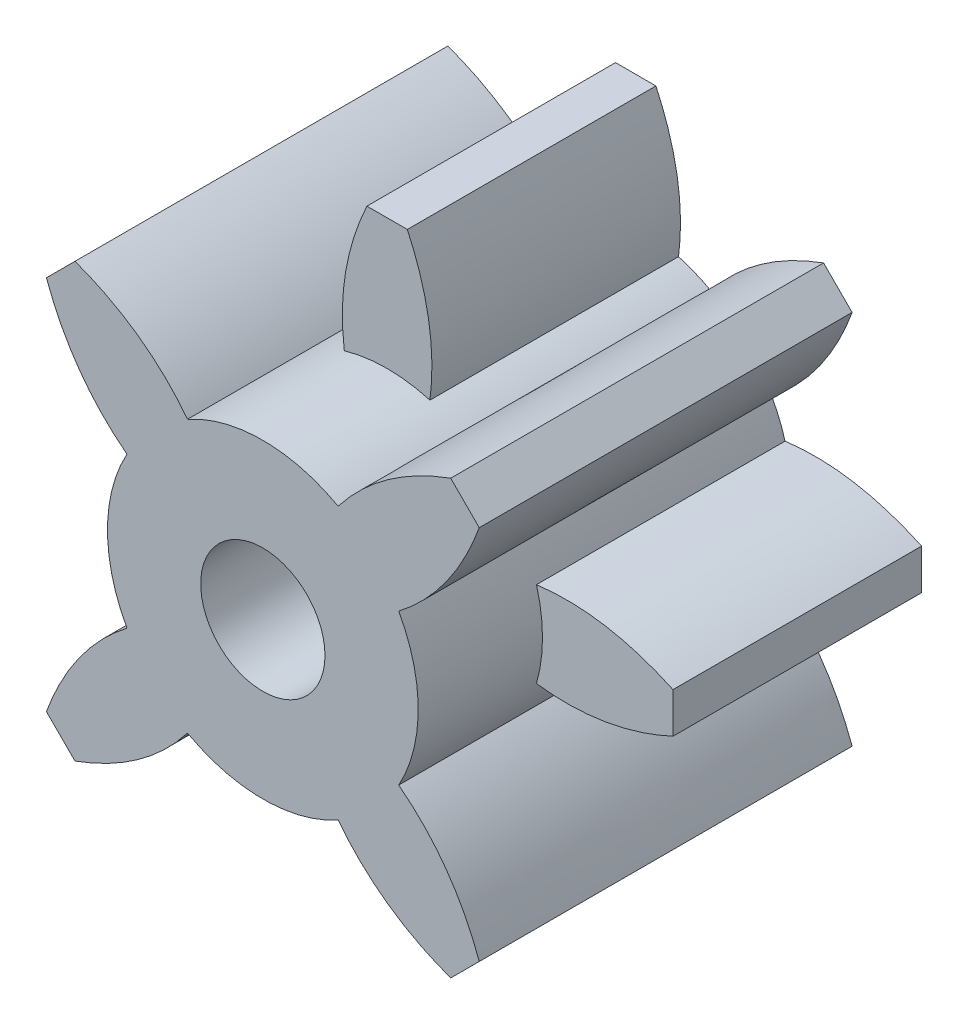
ISO-10303-21;
HEADER;
FILE_DESCRIPTION(('STEP AP214'),'2;1');
FILE_NAME('part.step','',(''),(''),'','','');
FILE_SCHEMA(('AUTOMOTIVE_DESIGN { 1 0 10303 214 1 1 1 1 }'));
ENDSEC;
DATA;
#1=APPLICATION_CONTEXT('core data for automotive mechanical design processes');
#2=APPLICATION_PROTOCOL_DEFINITION('international standard','automotive_design',2000,#1);
#3=PRODUCT_CONTEXT('',#1,'mechanical');
#4=PRODUCT('Part','Part','',(#3));
#5=PRODUCT_RELATED_PRODUCT_CATEGORY('part','',(#4));
#6=PRODUCT_DEFINITION_FORMATION('','',#4);
#7=PRODUCT_DEFINITION_CONTEXT('part definition',#1,'design');
#8=PRODUCT_DEFINITION('design','',#6,#7);
#9=PRODUCT_DEFINITION_SHAPE('','',#8);
#10=(LENGTH_UNIT() NAMED_UNIT(*) SI_UNIT(.MILLI.,.METRE.));
#11=(NAMED_UNIT(*) PLANE_ANGLE_UNIT() SI_UNIT($,.RADIAN.));
#12=(NAMED_UNIT(*) SI_UNIT($,.STERADIAN.) SOLID_ANGLE_UNIT());
#13=UNCERTAINTY_MEASURE_WITH_UNIT(LENGTH_MEASURE(1.E-05),#10,'distance_accuracy_value','');
#14=(GEOMETRIC_REPRESENTATION_CONTEXT(3) GLOBAL_UNCERTAINTY_ASSIGNED_CONTEXT((#13)) GLOBAL_UNIT_ASSIGNED_CONTEXT((#10,
#11,#12)) REPRESENTATION_CONTEXT('',''));
#15=CARTESIAN_POINT('',(0.,0.,0.));
#16=DIRECTION('',(0.,0.,1.));
#17=DIRECTION('',(1.,0.,0.));
#18=AXIS2_PLACEMENT_3D('',#15,#16,#17);
#19=CARTESIAN_POINT('',(0.,63.,-30.));
#20=DIRECTION('',(0.,0.,1.));
#21=DIRECTION('',(1.,0.,0.));
#22=AXIS2_PLACEMENT_3D('',#19,#20,#21);
#23=CYLINDRICAL_SURFACE('',#22,12.5);
#24=DIRECTION('',(0.,0.,1.));
#25=VECTOR('',#24,1.);
#26=CARTESIAN_POINT('',(-12.015771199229,66.4454669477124,-30.));
#27=LINE('',#26,#25);
#28=CARTESIAN_POINT('',(-12.015771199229,66.4454669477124,-30.));
#29=VERTEX_POINT('',#28);
#30=CARTESIAN_POINT('',(-12.0157712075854,66.4454669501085,-10.));
#31=VERTEX_POINT('',#30);
#32=EDGE_CURVE('E573',#29,#31,#27,.T.);
#33=ORIENTED_EDGE('',*,*,#32,.T.);
#34=CARTESIAN_POINT('',(0.,63.,-10.));
#35=DIRECTION('',(0.,0.,-1.));
#36=DIRECTION('',(1.,0.,0.));
#37=AXIS2_PLACEMENT_3D('',#34,#35,#36);
#38=CIRCLE('',#37,12.5000000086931);
#39=CARTESIAN_POINT('',(-12.0157712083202,59.5545330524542,-10.));
#40=VERTEX_POINT('',#39);
#41=EDGE_CURVE('E754',#40,#31,#38,.T.);
#42=ORIENTED_EDGE('',*,*,#41,.F.);
#43=DIRECTION('',(0.,0.,1.));
#44=VECTOR('',#43,1.);
#45=CARTESIAN_POINT('',(-12.0157712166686,59.5545330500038,-30.));
#46=LINE('',#45,#44);
#47=CARTESIAN_POINT('',(-12.0157712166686,59.5545330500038,-30.));
#48=VERTEX_POINT('',#47);
#49=EDGE_CURVE('E820',#48,#40,#46,.T.);
#50=ORIENTED_EDGE('',*,*,#49,.F.);
#51=CARTESIAN_POINT('',(0.,63.,-30.));
#52=DIRECTION('',(0.,0.,1.));
#53=DIRECTION('',(1.,0.,0.));
#54=AXIS2_PLACEMENT_3D('',#51,#52,#53);
#55=CIRCLE('',#54,12.5);
#56=CARTESIAN_POINT('',(-10.9327463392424,56.9398797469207,-30.));
#57=VERTEX_POINT('',#56);
#58=EDGE_CURVE('E477',#48,#57,#55,.T.);
#59=ORIENTED_EDGE('',*,*,#58,.T.);
#60=DIRECTION('',(0.,0.,1.));
#61=VECTOR('',#60,1.);
#62=CARTESIAN_POINT('',(-10.9327463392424,56.9398797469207,-30.));
#63=LINE('',#62,#61);
#64=CARTESIAN_POINT('',(-10.9327463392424,56.9398797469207,0.));
#65=VERTEX_POINT('',#64);
#66=EDGE_CURVE('E512',#57,#65,#63,.T.);
#67=ORIENTED_EDGE('',*,*,#66,.T.);
#68=CARTESIAN_POINT('',(0.,63.,0.));
#69=DIRECTION('',(0.,0.,1.));
#70=DIRECTION('',(1.,0.,0.));
#71=AXIS2_PLACEMENT_3D('',#68,#69,#70);
#72=CIRCLE('',#71,12.5);
#73=CARTESIAN_POINT('',(-10.9327463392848,69.0601202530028,0.));
#74=VERTEX_POINT('',#73);
#75=EDGE_CURVE('E443',#74,#65,#72,.T.);
#76=ORIENTED_EDGE('',*,*,#75,.F.);
#77=DIRECTION('',(0.,0.,1.));
#78=VECTOR('',#77,1.);
#79=CARTESIAN_POINT('',(-10.9327463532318,69.0601202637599,-30.));
#80=LINE('',#79,#78);
#81=CARTESIAN_POINT('',(-10.9327463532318,69.0601202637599,-30.));
#82=VERTEX_POINT('',#81);
#83=EDGE_CURVE('E594',#82,#74,#80,.T.);
#84=ORIENTED_EDGE('',*,*,#83,.F.);
#85=EDGE_CURVE('E474',#82,#29,#55,.T.);
#86=ORIENTED_EDGE('',*,*,#85,.T.);
#87=EDGE_LOOP('',(#33,#42,#50,#59,#67,#76,#84,#86));
#88=FACE_BOUND('',#87,.T.);
#89=ADVANCED_FACE('F39',(#88),#23,.T.);
#90=DIRECTION('',(0.,0.,1.));
#91=VECTOR('',#90,1.);
#92=CARTESIAN_POINT('',(3.44546694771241,75.015771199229,-30.));
#93=LINE('',#92,#91);
#94=CARTESIAN_POINT('',(3.44546694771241,75.015771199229,-30.));
#95=VERTEX_POINT('',#94);
#96=CARTESIAN_POINT('',(3.44546695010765,75.0157712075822,-10.));
#97=VERTEX_POINT('',#96);
#98=EDGE_CURVE('E651',#95,#97,#93,.T.);
#99=ORIENTED_EDGE('',*,*,#98,.T.);
#100=CARTESIAN_POINT('',(0.,63.,-10.));
#101=DIRECTION('',(0.,0.,-1.));
#102=DIRECTION('',(1.,0.,0.));
#103=AXIS2_PLACEMENT_3D('',#100,#101,#102);
#104=CIRCLE('',#103,12.5000000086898);
#105=CARTESIAN_POINT('',(-3.4454669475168,75.0157712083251,-10.));
#106=VERTEX_POINT('',#105);
#107=EDGE_CURVE('E727',#106,#97,#104,.T.);
#108=ORIENTED_EDGE('',*,*,#107,.F.);
#109=DIRECTION('',(0.,0.,1.));
#110=VECTOR('',#109,1.);
#111=CARTESIAN_POINT('',(-3.44546695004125,75.0157712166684,-30.));
#112=LINE('',#111,#110);
#113=CARTESIAN_POINT('',(-3.44546695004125,75.0157712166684,-30.));
#114=VERTEX_POINT('',#113);
#115=EDGE_CURVE('E854',#114,#106,#112,.T.);
#116=ORIENTED_EDGE('',*,*,#115,.F.);
#117=CARTESIAN_POINT('',(-6.06012025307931,73.9327463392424,-30.));
#118=VERTEX_POINT('',#117);
#119=EDGE_CURVE('E471',#114,#118,#55,.T.);
#120=ORIENTED_EDGE('',*,*,#119,.T.);
#121=DIRECTION('',(0.,0.,1.));
#122=VECTOR('',#121,1.);
#123=CARTESIAN_POINT('',(-6.06012025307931,73.9327463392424,-30.));
#124=LINE('',#123,#122);
#125=CARTESIAN_POINT('',(-6.06012025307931,73.9327463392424,0.));
#126=VERTEX_POINT('',#125);
#127=EDGE_CURVE('E586',#118,#126,#124,.T.);
#128=ORIENTED_EDGE('',*,*,#127,.T.);
#129=CARTESIAN_POINT('',(6.06012025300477,73.9327463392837,0.));
#130=VERTEX_POINT('',#129);
#131=EDGE_CURVE('E482',#130,#126,#72,.T.);
#132=ORIENTED_EDGE('',*,*,#131,.F.);
#133=DIRECTION('',(0.,0.,1.));
#134=VECTOR('',#133,1.);
#135=CARTESIAN_POINT('',(6.0601202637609,73.9327463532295,-30.));
#136=LINE('',#135,#134);
#137=CARTESIAN_POINT('',(6.0601202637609,73.9327463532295,-30.));
#138=VERTEX_POINT('',#137);
#139=EDGE_CURVE('E672',#138,#130,#136,.T.);
#140=ORIENTED_EDGE('',*,*,#139,.F.);
#141=EDGE_CURVE('E468',#138,#95,#55,.T.);
#142=ORIENTED_EDGE('',*,*,#141,.T.);
#143=EDGE_LOOP('',(#99,#108,#116,#120,#128,#132,#140,#142));
#144=FACE_BOUND('',#143,.T.);
#145=ADVANCED_FACE('F308',(#144),#23,.T.);
#146=DIRECTION('',(0.,0.,1.));
#147=VECTOR('',#146,1.);
#148=CARTESIAN_POINT('',(12.015771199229,59.5545330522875,-30.));
#149=LINE('',#148,#147);
#150=CARTESIAN_POINT('',(12.015771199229,59.5545330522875,-30.));
#151=VERTEX_POINT('',#150);
#152=CARTESIAN_POINT('',(12.0157712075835,59.5545330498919,-10.));
#153=VERTEX_POINT('',#152);
#154=EDGE_CURVE('E338',#151,#153,#149,.T.);
#155=ORIENTED_EDGE('',*,*,#154,.T.);
#156=CARTESIAN_POINT('',(0.,63.,-10.));
#157=DIRECTION('',(0.,0.,-1.));
#158=DIRECTION('',(1.,0.,0.));
#159=AXIS2_PLACEMENT_3D('',#156,#157,#158);
#160=CIRCLE('',#159,12.5000000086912);
#161=CARTESIAN_POINT('',(12.0157712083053,66.4454669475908,-10.));
#162=VERTEX_POINT('',#161);
#163=EDGE_CURVE('E262',#162,#153,#160,.T.);
#164=ORIENTED_EDGE('',*,*,#163,.F.);
#165=DIRECTION('',(0.,0.,1.));
#166=VECTOR('',#165,1.);
#167=CARTESIAN_POINT('',(12.0157712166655,66.4454669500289,-30.));
#168=LINE('',#167,#166);
#169=CARTESIAN_POINT('',(12.0157712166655,66.4454669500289,-30.));
#170=VERTEX_POINT('',#169);
#171=EDGE_CURVE('E349',#170,#162,#168,.T.);
#172=ORIENTED_EDGE('',*,*,#171,.F.);
#173=CARTESIAN_POINT('',(10.9327463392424,69.0601202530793,-30.));
#174=VERTEX_POINT('',#173);
#175=EDGE_CURVE('E465',#170,#174,#55,.T.);
#176=ORIENTED_EDGE('',*,*,#175,.T.);
#177=DIRECTION('',(0.,0.,1.));
#178=VECTOR('',#177,1.);
#179=CARTESIAN_POINT('',(10.9327463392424,69.0601202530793,-30.));
#180=LINE('',#179,#178);
#181=CARTESIAN_POINT('',(10.9327463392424,69.0601202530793,0.));
#182=VERTEX_POINT('',#181);
#183=EDGE_CURVE('E664',#174,#182,#180,.T.);
#184=ORIENTED_EDGE('',*,*,#183,.T.);
#185=CARTESIAN_POINT('',(10.932746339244,56.9398797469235,0.));
#186=VERTEX_POINT('',#185);
#187=EDGE_CURVE('E455',#186,#182,#72,.T.);
#188=ORIENTED_EDGE('',*,*,#187,.F.);
#189=DIRECTION('',(0.,0.,1.));
#190=VECTOR('',#189,1.);
#191=CARTESIAN_POINT('',(10.9327463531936,56.9398797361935,-30.));
#192=LINE('',#191,#190);
#193=CARTESIAN_POINT('',(10.9327463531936,56.9398797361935,-30.));
#194=VERTEX_POINT('',#193);
#195=EDGE_CURVE('E430',#194,#186,#192,.T.);
#196=ORIENTED_EDGE('',*,*,#195,.F.);
#197=EDGE_CURVE('E343',#194,#151,#55,.T.);
#198=ORIENTED_EDGE('',*,*,#197,.T.);
#199=EDGE_LOOP('',(#155,#164,#172,#176,#184,#188,#196,#198));
#200=FACE_BOUND('',#199,.T.);
#201=ADVANCED_FACE('F315',(#200),#23,.T.);
#202=CARTESIAN_POINT('',(999733.592448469,23772.4155449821,-30.));
#203=CARTESIAN_POINT('',(-999848.383256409,-17570.2259801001,-30.));
#204=CARTESIAN_POINT('',(999948.773053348,11560.9461127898,-30.));
#205=B_SPLINE_CURVE_WITH_KNOTS('',2,(#202,#203,#204),.UNSPECIFIED.,.F.,.F.,(3,3),(0.,1.),.UNSPECIFIED.);
#206=DIRECTION('',(0.,0.,1.));
#207=VECTOR('',#206,1.);
#208=SURFACE_OF_LINEAR_EXTRUSION('',#205,#207);
#209=CARTESIAN_POINT('',(999733.59244847,23772.4155449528,-10.));
#210=CARTESIAN_POINT('',(-999848.383256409,-17570.2259801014,-10.));
#211=CARTESIAN_POINT('',(999948.773053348,11560.9461128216,-10.));
#212=B_SPLINE_CURVE_WITH_KNOTS('',2,(#209,#210,#211),.UNSPECIFIED.,.F.,.F.,(3,3),(0.,1.),.UNSPECIFIED.);
#213=CARTESIAN_POINT('',(-3.44546695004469,50.9842287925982,-10.));
#214=VERTEX_POINT('',#213);
#215=CARTESIAN_POINT('',(-1.62499998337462,39.999999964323,-10.));
#216=VERTEX_POINT('',#215);
#217=EDGE_CURVE('E251',#214,#216,#212,.T.);
#218=ORIENTED_EDGE('',*,*,#217,.F.);
#219=DIRECTION('',(0.,0.,1.));
#220=VECTOR('',#219,1.);
#221=CARTESIAN_POINT('',(-3.4454669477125,50.984228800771,-30.));
#222=LINE('',#221,#220);
#223=CARTESIAN_POINT('',(-3.44546694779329,50.9842288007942,-30.));
#224=VERTEX_POINT('',#223);
#225=EDGE_CURVE('E11',#224,#214,#222,.T.);
#226=ORIENTED_EDGE('',*,*,#225,.F.);
#227=CARTESIAN_POINT('',(-1.625,40.,-30.));
#228=VERTEX_POINT('',#227);
#229=EDGE_CURVE('E275',#224,#228,#205,.T.);
#230=ORIENTED_EDGE('',*,*,#229,.T.);
#231=DIRECTION('',(0.,0.,1.));
#232=VECTOR('',#231,1.);
#233=CARTESIAN_POINT('',(-1.625,40.,-30.));
#234=LINE('',#233,#232);
#235=EDGE_CURVE('E44',#228,#216,#234,.T.);
#236=ORIENTED_EDGE('',*,*,#235,.T.);
#237=EDGE_LOOP('',(#218,#226,#230,#236));
#238=FACE_BOUND('',#237,.T.);
#239=ADVANCED_FACE('F41',(#238),#208,.T.);
#240=CARTESIAN_POINT('',(-999948.773053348,11560.9461127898,-30.));
#241=CARTESIAN_POINT('',(999848.383256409,-17570.2259801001,-30.));
#242=CARTESIAN_POINT('',(-999733.592448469,23772.4155449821,-30.));
#243=B_SPLINE_CURVE_WITH_KNOTS('',2,(#240,#241,#242),.UNSPECIFIED.,.F.,.F.,(3,3),(0.,1.),.UNSPECIFIED.);
#244=DIRECTION('',(0.,0.,1.));
#245=VECTOR('',#244,1.);
#246=SURFACE_OF_LINEAR_EXTRUSION('',#243,#245);
#247=CARTESIAN_POINT('',(-999948.773053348,11560.9461127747,-10.));
#248=CARTESIAN_POINT('',(999848.383256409,-17570.2259800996,-10.));
#249=CARTESIAN_POINT('',(-999733.592448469,23772.415544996,-10.));
#250=B_SPLINE_CURVE_WITH_KNOTS('',2,(#247,#248,#249),.UNSPECIFIED.,.F.,.F.,(3,3),(0.,1.),.UNSPECIFIED.);
#251=CARTESIAN_POINT('',(1.62500000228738,40.0000000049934,-10.));
#252=VERTEX_POINT('',#251);
#253=CARTESIAN_POINT('',(3.44546694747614,50.9842287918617,-10.));
#254=VERTEX_POINT('',#253);
#255=EDGE_CURVE('E271',#252,#254,#250,.T.);
#256=ORIENTED_EDGE('',*,*,#255,.F.);
#257=DIRECTION('',(0.,0.,1.));
#258=VECTOR('',#257,1.);
#259=CARTESIAN_POINT('',(1.625,40.,-30.));
#260=LINE('',#259,#258);
#261=CARTESIAN_POINT('',(1.625,40.,-30.));
#262=VERTEX_POINT('',#261);
#263=EDGE_CURVE('E269',#262,#252,#260,.T.);
#264=ORIENTED_EDGE('',*,*,#263,.F.);
#265=CARTESIAN_POINT('',(3.44546694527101,50.9842288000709,-30.));
#266=VERTEX_POINT('',#265);
#267=EDGE_CURVE('E277',#262,#266,#243,.T.);
#268=ORIENTED_EDGE('',*,*,#267,.T.);
#269=DIRECTION('',(0.,0.,1.));
#270=VECTOR('',#269,1.);
#271=CARTESIAN_POINT('',(3.44546695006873,50.9842287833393,-30.));
#272=LINE('',#271,#270);
#273=EDGE_CURVE('E50',#266,#254,#272,.T.);
#274=ORIENTED_EDGE('',*,*,#273,.T.);
#275=EDGE_LOOP('',(#256,#264,#268,#274));
#276=FACE_BOUND('',#275,.T.);
#277=ADVANCED_FACE('F296',(#276),#246,.T.);
#278=CARTESIAN_POINT('',(-1.625,40.,-30.));
#279=DIRECTION('',(0.,-1.,0.));
#280=DIRECTION('',(0.,0.,-1.));
#281=AXIS2_PLACEMENT_3D('',#278,#279,#280);
#282=PLANE('',#281);
#283=DIRECTION('',(1.,1.09775330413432E-08,0.));
#284=VECTOR('',#283,1.);
#285=CARTESIAN_POINT('',(-1.62499998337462,39.999999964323,-10.));
#286=LINE('',#285,#284);
#287=EDGE_CURVE('E254',#216,#252,#286,.T.);
#288=ORIENTED_EDGE('',*,*,#287,.F.);
#289=ORIENTED_EDGE('',*,*,#235,.F.);
#290=DIRECTION('',(1.,0.,0.));
#291=VECTOR('',#290,1.);
#292=CARTESIAN_POINT('',(-1.625,40.,-30.));
#293=LINE('',#292,#291);
#294=EDGE_CURVE('E281',#228,#262,#293,.T.);
#295=ORIENTED_EDGE('',*,*,#294,.T.);
#296=ORIENTED_EDGE('',*,*,#263,.T.);
#297=EDGE_LOOP('',(#288,#289,#295,#296));
#298=FACE_BOUND('',#297,.T.);
#299=ADVANCED_FACE('F266',(#298),#282,.T.);
#300=CARTESIAN_POINT('',(-3.60025275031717,48.2274243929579,-30.));
#301=DIRECTION('',(0.,0.,1.));
#302=DIRECTION('',(1.,0.,0.));
#303=AXIS2_PLACEMENT_3D('',#300,#301,#302);
#304=PLANE('',#303);
#305=ORIENTED_EDGE('',*,*,#229,.F.);
#306=CARTESIAN_POINT('',(-6.06012026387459,52.067253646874,-30.));
#307=VERTEX_POINT('',#306);
#308=EDGE_CURVE('E451',#307,#224,#55,.T.);
#309=ORIENTED_EDGE('',*,*,#308,.F.);
#310=CARTESIAN_POINT('',(-698940.282599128,715263.833931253,-30.));
#311=CARTESIAN_POINT('',(694530.998294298,-719405.145623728,-30.));
#312=CARTESIAN_POINT('',(-690153.314090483,723746.49111012,-30.));
#313=B_SPLINE_CURVE_WITH_KNOTS('',2,(#310,#311,#312),.UNSPECIFIED.,.F.,.F.,(3,3),(0.,1.),.UNSPECIFIED.);
#314=CARTESIAN_POINT('',(-15.1144074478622,45.5874955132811,-30.));
#315=VERTEX_POINT('',#314);
#316=EDGE_CURVE('E509',#315,#307,#313,.T.);
#317=ORIENTED_EDGE('',*,*,#316,.F.);
#318=DIRECTION('',(0.707106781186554,-0.707106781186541,0.));
#319=VECTOR('',#318,1.);
#320=CARTESIAN_POINT('',(-17.4125044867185,47.8855925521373,-30.));
#321=LINE('',#320,#319);
#322=CARTESIAN_POINT('',(-17.4125044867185,47.8855925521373,-30.));
#323=VERTEX_POINT('',#322);
#324=EDGE_CURVE('E794',#323,#315,#321,.T.);
#325=ORIENTED_EDGE('',*,*,#324,.F.);
#326=CARTESIAN_POINT('',(723683.491110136,-690090.314090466,-30.));
#327=CARTESIAN_POINT('',(-719468.145623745,694593.99829428,-30.));
#328=CARTESIAN_POINT('',(715200.83393127,-698877.282599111,-30.));
#329=B_SPLINE_CURVE_WITH_KNOTS('',2,(#326,#327,#328),.UNSPECIFIED.,.F.,.F.,(3,3),(0.,1.),.UNSPECIFIED.);
#330=EDGE_CURVE('E504',#57,#323,#329,.T.);
#331=ORIENTED_EDGE('',*,*,#330,.F.);
#332=ORIENTED_EDGE('',*,*,#58,.F.);
#333=CARTESIAN_POINT('',(11497.9461127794,1000011.77305335,-30.));
#334=CARTESIAN_POINT('',(-17633.2259800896,-999785.383256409,-30.));
#335=CARTESIAN_POINT('',(23709.4155449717,999796.59244847,-30.));
#336=B_SPLINE_CURVE_WITH_KNOTS('',2,(#333,#334,#335),.UNSPECIFIED.,.F.,.F.,(3,3),(0.,1.),.UNSPECIFIED.);
#337=CARTESIAN_POINT('',(-23.,61.3749999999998,-30.));
#338=VERTEX_POINT('',#337);
#339=EDGE_CURVE('E808',#338,#48,#336,.T.);
#340=ORIENTED_EDGE('',*,*,#339,.F.);
#341=DIRECTION('',(0.,-1.,0.));
#342=VECTOR('',#341,1.);
#343=CARTESIAN_POINT('',(-23.,64.6249999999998,-30.));
#344=LINE('',#343,#342);
#345=CARTESIAN_POINT('',(-23.,64.6249999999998,-30.));
#346=VERTEX_POINT('',#345);
#347=EDGE_CURVE('E531',#346,#338,#344,.T.);
#348=ORIENTED_EDGE('',*,*,#347,.F.);
#349=CARTESIAN_POINT('',(23709.4155449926,-999670.592448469,-30.));
#350=CARTESIAN_POINT('',(-17633.2259801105,999911.383256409,-30.));
#351=CARTESIAN_POINT('',(11497.9461128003,-999885.773053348,-30.));
#352=B_SPLINE_CURVE_WITH_KNOTS('',2,(#349,#350,#351),.UNSPECIFIED.,.F.,.F.,(3,3),(0.,1.),.UNSPECIFIED.);
#353=EDGE_CURVE('E518',#29,#346,#352,.T.);
#354=ORIENTED_EDGE('',*,*,#353,.F.);
#355=ORIENTED_EDGE('',*,*,#85,.F.);
#356=CARTESIAN_POINT('',(715200.833931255,699003.282599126,-30.));
#357=CARTESIAN_POINT('',(-719468.14562373,-694467.998294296,-30.));
#358=CARTESIAN_POINT('',(723683.491110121,690216.314090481,-30.));
#359=B_SPLINE_CURVE_WITH_KNOTS('',2,(#356,#357,#358),.UNSPECIFIED.,.F.,.F.,(3,3),(0.,1.),.UNSPECIFIED.);
#360=CARTESIAN_POINT('',(-17.4125044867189,78.1144074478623,-30.));
#361=VERTEX_POINT('',#360);
#362=EDGE_CURVE('E553',#361,#82,#359,.T.);
#363=ORIENTED_EDGE('',*,*,#362,.F.);
#364=DIRECTION('',(-0.707106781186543,-0.707106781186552,0.));
#365=VECTOR('',#364,1.);
#366=CARTESIAN_POINT('',(-15.1144074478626,80.4125044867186,-30.));
#367=LINE('',#366,#365);
#368=CARTESIAN_POINT('',(-15.1144074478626,80.4125044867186,-30.));
#369=VERTEX_POINT('',#368);
#370=EDGE_CURVE('E561',#369,#361,#367,.T.);
#371=ORIENTED_EDGE('',*,*,#370,.F.);
#372=CARTESIAN_POINT('',(-690153.314090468,-723620.491110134,-30.));
#373=CARTESIAN_POINT('',(694530.998294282,719531.145623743,-30.));
#374=CARTESIAN_POINT('',(-698940.282599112,-715137.833931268,-30.));
#375=B_SPLINE_CURVE_WITH_KNOTS('',2,(#372,#373,#374),.UNSPECIFIED.,.F.,.F.,(3,3),(0.,1.),.UNSPECIFIED.);
#376=EDGE_CURVE('E585',#118,#369,#375,.T.);
#377=ORIENTED_EDGE('',*,*,#376,.F.);
#378=ORIENTED_EDGE('',*,*,#119,.F.);
#379=CARTESIAN_POINT('',(999948.773053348,-11434.9461127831,-30.));
#380=CARTESIAN_POINT('',(-999848.383256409,17696.2259800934,-30.));
#381=CARTESIAN_POINT('',(999733.59244847,-23646.4155449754,-30.));
#382=B_SPLINE_CURVE_WITH_KNOTS('',2,(#379,#380,#381),.UNSPECIFIED.,.F.,.F.,(3,3),(0.,1.),.UNSPECIFIED.);
#383=CARTESIAN_POINT('',(-1.62500000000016,86.,-30.));
#384=VERTEX_POINT('',#383);
#385=EDGE_CURVE('E842',#384,#114,#382,.T.);
#386=ORIENTED_EDGE('',*,*,#385,.F.);
#387=DIRECTION('',(-1.,0.,0.));
#388=VECTOR('',#387,1.);
#389=CARTESIAN_POINT('',(1.62499999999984,86.,-30.));
#390=LINE('',#389,#388);
#391=CARTESIAN_POINT('',(1.62499999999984,86.,-30.));
#392=VERTEX_POINT('',#391);
#393=EDGE_CURVE('E609',#392,#384,#390,.T.);
#394=ORIENTED_EDGE('',*,*,#393,.F.);
#395=CARTESIAN_POINT('',(-999733.592448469,-23646.4155449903,-30.));
#396=CARTESIAN_POINT('',(999848.383256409,17696.2259801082,-30.));
#397=CARTESIAN_POINT('',(-999948.773053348,-11434.946112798,-30.));
#398=B_SPLINE_CURVE_WITH_KNOTS('',2,(#395,#396,#397),.UNSPECIFIED.,.F.,.F.,(3,3),(0.,1.),.UNSPECIFIED.);
#399=EDGE_CURVE('E593',#95,#392,#398,.T.);
#400=ORIENTED_EDGE('',*,*,#399,.F.);
#401=ORIENTED_EDGE('',*,*,#141,.F.);
#402=CARTESIAN_POINT('',(698940.282599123,-715137.833931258,-30.));
#403=CARTESIAN_POINT('',(-694530.998294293,719531.145623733,-30.));
#404=CARTESIAN_POINT('',(690153.314090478,-723620.491110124,-30.));
#405=B_SPLINE_CURVE_WITH_KNOTS('',2,(#402,#403,#404),.UNSPECIFIED.,.F.,.F.,(3,3),(0.,1.),.UNSPECIFIED.);
#406=CARTESIAN_POINT('',(15.1144074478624,80.4125044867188,-30.));
#407=VERTEX_POINT('',#406);
#408=EDGE_CURVE('E631',#407,#138,#405,.T.);
#409=ORIENTED_EDGE('',*,*,#408,.F.);
#410=DIRECTION('',(-0.707106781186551,0.707106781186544,0.));
#411=VECTOR('',#410,1.);
#412=CARTESIAN_POINT('',(17.4125044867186,78.1144074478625,-30.));
#413=LINE('',#412,#411);
#414=CARTESIAN_POINT('',(17.4125044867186,78.1144074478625,-30.));
#415=VERTEX_POINT('',#414);
#416=EDGE_CURVE('E639',#415,#407,#413,.T.);
#417=ORIENTED_EDGE('',*,*,#416,.F.);
#418=CARTESIAN_POINT('',(-723683.491110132,690216.31409047,-30.));
#419=CARTESIAN_POINT('',(719468.145623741,-694467.998294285,-30.));
#420=CARTESIAN_POINT('',(-715200.833931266,699003.282599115,-30.));
#421=B_SPLINE_CURVE_WITH_KNOTS('',2,(#418,#419,#420),.UNSPECIFIED.,.F.,.F.,(3,3),(0.,1.),.UNSPECIFIED.);
#422=EDGE_CURVE('E663',#174,#415,#421,.T.);
#423=ORIENTED_EDGE('',*,*,#422,.F.);
#424=ORIENTED_EDGE('',*,*,#175,.F.);
#425=CARTESIAN_POINT('',(-11497.9461127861,-999885.773053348,-30.));
#426=CARTESIAN_POINT('',(17633.2259800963,999911.383256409,-30.));
#427=CARTESIAN_POINT('',(-23709.4155449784,-999670.592448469,-30.));
#428=B_SPLINE_CURVE_WITH_KNOTS('',2,(#425,#426,#427),.UNSPECIFIED.,.F.,.F.,(3,3),(0.,1.),.UNSPECIFIED.);
#429=CARTESIAN_POINT('',(23.,64.6250000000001,-30.));
#430=VERTEX_POINT('',#429);
#431=EDGE_CURVE('E359',#430,#170,#428,.T.);
#432=ORIENTED_EDGE('',*,*,#431,.F.);
#433=DIRECTION('',(0.,1.,0.));
#434=VECTOR('',#433,1.);
#435=CARTESIAN_POINT('',(23.,61.3750000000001,-30.));
#436=LINE('',#435,#434);
#437=CARTESIAN_POINT('',(23.,61.3750000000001,-30.));
#438=VERTEX_POINT('',#437);
#439=EDGE_CURVE('E684',#438,#430,#436,.T.);
#440=ORIENTED_EDGE('',*,*,#439,.F.);
#441=CARTESIAN_POINT('',(-23709.4155449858,999796.592448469,-30.));
#442=CARTESIAN_POINT('',(17633.2259801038,-999785.383256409,-30.));
#443=CARTESIAN_POINT('',(-11497.9461127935,1000011.77305335,-30.));
#444=B_SPLINE_CURVE_WITH_KNOTS('',2,(#441,#442,#443),.UNSPECIFIED.,.F.,.F.,(3,3),(0.,1.),.UNSPECIFIED.);
#445=EDGE_CURVE('E671',#151,#438,#444,.T.);
#446=ORIENTED_EDGE('',*,*,#445,.F.);
#447=ORIENTED_EDGE('',*,*,#197,.F.);
#448=CARTESIAN_POINT('',(-715200.83393126,-698877.282599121,-30.));
#449=CARTESIAN_POINT('',(719468.145623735,694593.998294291,-30.));
#450=CARTESIAN_POINT('',(-723683.491110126,-690090.314090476,-30.));
#451=B_SPLINE_CURVE_WITH_KNOTS('',2,(#448,#449,#450),.UNSPECIFIED.,.F.,.F.,(3,3),(0.,1.),.UNSPECIFIED.);
#452=CARTESIAN_POINT('',(17.4125044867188,47.8855925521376,-30.));
#453=VERTEX_POINT('',#452);
#454=EDGE_CURVE('E400',#453,#194,#451,.T.);
#455=ORIENTED_EDGE('',*,*,#454,.F.);
#456=DIRECTION('',(0.707106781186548,0.707106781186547,0.));
#457=VECTOR('',#456,1.);
#458=CARTESIAN_POINT('',(15.1144074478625,45.5874955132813,-30.));
#459=LINE('',#458,#457);
#460=CARTESIAN_POINT('',(15.1144074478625,45.5874955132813,-30.));
#461=VERTEX_POINT('',#460);
#462=EDGE_CURVE('E379',#461,#453,#459,.T.);
#463=ORIENTED_EDGE('',*,*,#462,.F.);
#464=CARTESIAN_POINT('',(690153.314090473,723746.491110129,-30.));
#465=CARTESIAN_POINT('',(-694530.998294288,-719405.145623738,-30.));
#466=CARTESIAN_POINT('',(698940.282599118,715263.833931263,-30.));
#467=B_SPLINE_CURVE_WITH_KNOTS('',2,(#464,#465,#466),.UNSPECIFIED.,.F.,.F.,(3,3),(0.,1.),.UNSPECIFIED.);
#468=CARTESIAN_POINT('',(6.06012025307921,52.0672536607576,-30.));
#469=VERTEX_POINT('',#468);
#470=EDGE_CURVE('E372',#469,#461,#467,.T.);
#471=ORIENTED_EDGE('',*,*,#470,.F.);
#472=EDGE_CURVE('E447',#266,#469,#55,.T.);
#473=ORIENTED_EDGE('',*,*,#472,.F.);
#474=ORIENTED_EDGE('',*,*,#267,.F.);
#475=ORIENTED_EDGE('',*,*,#294,.F.);
#476=EDGE_LOOP('',(#305,#309,#317,#325,#331,#332,#340,#348,#354,#355,#363,#371,#377,#378,#386,
#394,#400,#401,#409,#417,#423,#424,#432,#440,#446,#447,#455,#463,#471,#473,#474,#475));
#477=FACE_BOUND('',#476,.T.);
#478=CARTESIAN_POINT('',(0.,63.,-30.));
#479=DIRECTION('',(0.,0.,1.));
#480=DIRECTION('',(1.,0.,0.));
#481=AXIS2_PLACEMENT_3D('',#478,#479,#480);
#482=CIRCLE('',#481,5.);
#483=CARTESIAN_POINT('',(5.,63.,-30.));
#484=VERTEX_POINT('',#483);
#485=EDGE_CURVE('E439',#484,#484,#482,.T.);
#486=ORIENTED_EDGE('',*,*,#485,.T.);
#487=EDGE_LOOP('',(#486));
#488=FACE_BOUND('',#487,.T.);
#489=ADVANCED_FACE('F302',(#477,#488),#304,.F.);
#490=CARTESIAN_POINT('',(-3.60025275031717,48.2274243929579,0.));
#491=DIRECTION('',(0.,0.,1.));
#492=DIRECTION('',(1.,0.,0.));
#493=AXIS2_PLACEMENT_3D('',#490,#491,#492);
#494=PLANE('',#493);
#495=CARTESIAN_POINT('',(-698940.282599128,715263.833931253,0.));
#496=CARTESIAN_POINT('',(694530.998294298,-719405.145623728,0.));
#497=CARTESIAN_POINT('',(-690153.314090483,723746.49111012,0.));
#498=B_SPLINE_CURVE_WITH_KNOTS('',2,(#495,#496,#497),.UNSPECIFIED.,.F.,.F.,(3,3),(0.,1.),.UNSPECIFIED.);
#499=CARTESIAN_POINT('',(-15.1144074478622,45.5874955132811,0.));
#500=VERTEX_POINT('',#499);
#501=CARTESIAN_POINT('',(-6.06012025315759,52.067253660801,0.));
#502=VERTEX_POINT('',#501);
#503=EDGE_CURVE('E497',#500,#502,#498,.T.);
#504=ORIENTED_EDGE('',*,*,#503,.T.);
#505=CARTESIAN_POINT('',(6.06012025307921,52.0672536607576,0.));
#506=VERTEX_POINT('',#505);
#507=EDGE_CURVE('E452',#502,#506,#72,.T.);
#508=ORIENTED_EDGE('',*,*,#507,.T.);
#509=CARTESIAN_POINT('',(690153.314090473,723746.491110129,0.));
#510=CARTESIAN_POINT('',(-694530.998294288,-719405.145623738,0.));
#511=CARTESIAN_POINT('',(698940.282599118,715263.833931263,0.));
#512=B_SPLINE_CURVE_WITH_KNOTS('',2,(#509,#510,#511),.UNSPECIFIED.,.F.,.F.,(3,3),(0.,1.),.UNSPECIFIED.);
#513=CARTESIAN_POINT('',(15.1144074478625,45.5874955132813,0.));
#514=VERTEX_POINT('',#513);
#515=EDGE_CURVE('E348',#506,#514,#512,.T.);
#516=ORIENTED_EDGE('',*,*,#515,.T.);
#517=DIRECTION('',(0.707106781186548,0.707106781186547,0.));
#518=VECTOR('',#517,1.);
#519=CARTESIAN_POINT('',(15.1144074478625,45.5874955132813,0.));
#520=LINE('',#519,#518);
#521=CARTESIAN_POINT('',(17.4125044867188,47.8855925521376,0.));
#522=VERTEX_POINT('',#521);
#523=EDGE_CURVE('E354',#514,#522,#520,.T.);
#524=ORIENTED_EDGE('',*,*,#523,.T.);
#525=CARTESIAN_POINT('',(-715200.83393126,-698877.282599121,0.));
#526=CARTESIAN_POINT('',(719468.145623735,694593.998294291,0.));
#527=CARTESIAN_POINT('',(-723683.491110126,-690090.314090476,0.));
#528=B_SPLINE_CURVE_WITH_KNOTS('',2,(#525,#526,#527),.UNSPECIFIED.,.F.,.F.,(3,3),(0.,1.),.UNSPECIFIED.);
#529=EDGE_CURVE('E380',#522,#186,#528,.T.);
#530=ORIENTED_EDGE('',*,*,#529,.T.);
#531=ORIENTED_EDGE('',*,*,#187,.T.);
#532=CARTESIAN_POINT('',(-723683.491110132,690216.31409047,0.));
#533=CARTESIAN_POINT('',(719468.145623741,-694467.998294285,0.));
#534=CARTESIAN_POINT('',(-715200.833931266,699003.282599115,0.));
#535=B_SPLINE_CURVE_WITH_KNOTS('',2,(#532,#533,#534),.UNSPECIFIED.,.F.,.F.,(3,3),(0.,1.),.UNSPECIFIED.);
#536=CARTESIAN_POINT('',(17.4125044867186,78.1144074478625,0.));
#537=VERTEX_POINT('',#536);
#538=EDGE_CURVE('E641',#182,#537,#535,.T.);
#539=ORIENTED_EDGE('',*,*,#538,.T.);
#540=DIRECTION('',(-0.707106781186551,0.707106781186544,0.));
#541=VECTOR('',#540,1.);
#542=CARTESIAN_POINT('',(17.4125044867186,78.1144074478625,0.));
#543=LINE('',#542,#541);
#544=CARTESIAN_POINT('',(15.1144074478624,80.4125044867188,0.));
#545=VERTEX_POINT('',#544);
#546=EDGE_CURVE('E650',#537,#545,#543,.T.);
#547=ORIENTED_EDGE('',*,*,#546,.T.);
#548=CARTESIAN_POINT('',(698940.282599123,-715137.833931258,0.));
#549=CARTESIAN_POINT('',(-694530.998294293,719531.145623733,0.));
#550=CARTESIAN_POINT('',(690153.314090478,-723620.491110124,0.));
#551=B_SPLINE_CURVE_WITH_KNOTS('',2,(#548,#549,#550),.UNSPECIFIED.,.F.,.F.,(3,3),(0.,1.),.UNSPECIFIED.);
#552=EDGE_CURVE('E658',#545,#130,#551,.T.);
#553=ORIENTED_EDGE('',*,*,#552,.T.);
#554=ORIENTED_EDGE('',*,*,#131,.T.);
#555=CARTESIAN_POINT('',(-690153.314090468,-723620.491110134,0.));
#556=CARTESIAN_POINT('',(694530.998294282,719531.145623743,0.));
#557=CARTESIAN_POINT('',(-698940.282599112,-715137.833931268,0.));
#558=B_SPLINE_CURVE_WITH_KNOTS('',2,(#555,#556,#557),.UNSPECIFIED.,.F.,.F.,(3,3),(0.,1.),.UNSPECIFIED.);
#559=CARTESIAN_POINT('',(-15.1144074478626,80.4125044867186,0.));
#560=VERTEX_POINT('',#559);
#561=EDGE_CURVE('E563',#126,#560,#558,.T.);
#562=ORIENTED_EDGE('',*,*,#561,.T.);
#563=DIRECTION('',(-0.707106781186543,-0.707106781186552,0.));
#564=VECTOR('',#563,1.);
#565=CARTESIAN_POINT('',(-15.1144074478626,80.4125044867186,0.));
#566=LINE('',#565,#564);
#567=CARTESIAN_POINT('',(-17.4125044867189,78.1144074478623,0.));
#568=VERTEX_POINT('',#567);
#569=EDGE_CURVE('E572',#560,#568,#566,.T.);
#570=ORIENTED_EDGE('',*,*,#569,.T.);
#571=CARTESIAN_POINT('',(715200.833931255,699003.282599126,0.));
#572=CARTESIAN_POINT('',(-719468.14562373,-694467.998294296,0.));
#573=CARTESIAN_POINT('',(723683.491110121,690216.314090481,0.));
#574=B_SPLINE_CURVE_WITH_KNOTS('',2,(#571,#572,#573),.UNSPECIFIED.,.F.,.F.,(3,3),(0.,1.),.UNSPECIFIED.);
#575=EDGE_CURVE('E580',#568,#74,#574,.T.);
#576=ORIENTED_EDGE('',*,*,#575,.T.);
#577=ORIENTED_EDGE('',*,*,#75,.T.);
#578=CARTESIAN_POINT('',(723683.491110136,-690090.314090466,0.));
#579=CARTESIAN_POINT('',(-719468.145623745,694593.99829428,0.));
#580=CARTESIAN_POINT('',(715200.83393127,-698877.282599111,0.));
#581=B_SPLINE_CURVE_WITH_KNOTS('',2,(#578,#579,#580),.UNSPECIFIED.,.F.,.F.,(3,3),(0.,1.),.UNSPECIFIED.);
#582=CARTESIAN_POINT('',(-17.4125044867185,47.8855925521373,0.));
#583=VERTEX_POINT('',#582);
#584=EDGE_CURVE('E916',#65,#583,#581,.T.);
#585=ORIENTED_EDGE('',*,*,#584,.T.);
#586=DIRECTION('',(0.707106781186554,-0.707106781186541,0.));
#587=VECTOR('',#586,1.);
#588=CARTESIAN_POINT('',(-17.4125044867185,47.8855925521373,0.));
#589=LINE('',#588,#587);
#590=EDGE_CURVE('E501',#583,#500,#589,.T.);
#591=ORIENTED_EDGE('',*,*,#590,.T.);
#592=EDGE_LOOP('',(#504,#508,#516,#524,#530,#531,#539,#547,#553,#554,#562,#570,#576,#577,#585,#591));
#593=FACE_BOUND('',#592,.T.);
#594=CARTESIAN_POINT('',(0.,63.,0.));
#595=DIRECTION('',(0.,0.,1.));
#596=DIRECTION('',(1.,0.,0.));
#597=AXIS2_PLACEMENT_3D('',#594,#595,#596);
#598=CIRCLE('',#597,5.);
#599=CARTESIAN_POINT('',(5.,63.,0.));
#600=VERTEX_POINT('',#599);
#601=EDGE_CURVE('E429',#600,#600,#598,.T.);
#602=ORIENTED_EDGE('',*,*,#601,.F.);
#603=EDGE_LOOP('',(#602));
#604=FACE_BOUND('',#603,.T.);
#605=ADVANCED_FACE('F299',(#593,#604),#494,.T.);
#606=DIRECTION('',(0.,0.,1.));
#607=VECTOR('',#606,1.);
#608=CARTESIAN_POINT('',(-6.06012026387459,52.067253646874,-30.));
#609=LINE('',#608,#607);
#610=EDGE_CURVE('E506',#307,#502,#609,.T.);
#611=ORIENTED_EDGE('',*,*,#610,.F.);
#612=ORIENTED_EDGE('',*,*,#308,.T.);
#613=ORIENTED_EDGE('',*,*,#225,.T.);
#614=CARTESIAN_POINT('',(0.,63.,-10.));
#615=DIRECTION('',(0.,0.,-1.));
#616=DIRECTION('',(1.,0.,0.));
#617=AXIS2_PLACEMENT_3D('',#614,#615,#616);
#618=CIRCLE('',#617,12.500000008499);
#619=EDGE_CURVE('E257',#254,#214,#618,.T.);
#620=ORIENTED_EDGE('',*,*,#619,.F.);
#621=ORIENTED_EDGE('',*,*,#273,.F.);
#622=ORIENTED_EDGE('',*,*,#472,.T.);
#623=DIRECTION('',(0.,0.,1.));
#624=VECTOR('',#623,1.);
#625=CARTESIAN_POINT('',(6.06012025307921,52.0672536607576,-30.));
#626=LINE('',#625,#624);
#627=EDGE_CURVE('E422',#469,#506,#626,.T.);
#628=ORIENTED_EDGE('',*,*,#627,.T.);
#629=ORIENTED_EDGE('',*,*,#507,.F.);
#630=EDGE_LOOP('',(#611,#612,#613,#620,#621,#622,#628,#629));
#631=FACE_BOUND('',#630,.T.);
#632=ADVANCED_FACE('F311',(#631),#23,.T.);
#633=CARTESIAN_POINT('',(0.,63.,-30.));
#634=DIRECTION('',(0.,0.,1.));
#635=DIRECTION('',(1.,0.,0.));
#636=AXIS2_PLACEMENT_3D('',#633,#634,#635);
#637=CYLINDRICAL_SURFACE('',#636,5.);
#638=ORIENTED_EDGE('',*,*,#485,.F.);
#639=EDGE_LOOP('',(#638));
#640=FACE_BOUND('',#639,.T.);
#641=ORIENTED_EDGE('',*,*,#601,.T.);
#642=EDGE_LOOP('',(#641));
#643=FACE_BOUND('',#642,.T.);
#644=ADVANCED_FACE('F320',(#640,#643),#637,.F.);
#645=DIRECTION('',(0.,0.,1.));
#646=VECTOR('',#645,1.);
#647=SURFACE_OF_LINEAR_EXTRUSION('',#467,#646);
#648=ORIENTED_EDGE('',*,*,#515,.F.);
#649=ORIENTED_EDGE('',*,*,#627,.F.);
#650=ORIENTED_EDGE('',*,*,#470,.T.);
#651=DIRECTION('',(0.,0.,1.));
#652=VECTOR('',#651,1.);
#653=CARTESIAN_POINT('',(15.1144074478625,45.5874955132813,-30.));
#654=LINE('',#653,#652);
#655=EDGE_CURVE('E405',#461,#514,#654,.T.);
#656=ORIENTED_EDGE('',*,*,#655,.T.);
#657=EDGE_LOOP('',(#648,#649,#650,#656));
#658=FACE_BOUND('',#657,.T.);
#659=ADVANCED_FACE('F326',(#658),#647,.T.);
#660=DIRECTION('',(0.,0.,1.));
#661=VECTOR('',#660,1.);
#662=SURFACE_OF_LINEAR_EXTRUSION('',#451,#661);
#663=ORIENTED_EDGE('',*,*,#529,.F.);
#664=DIRECTION('',(0.,0.,1.));
#665=VECTOR('',#664,1.);
#666=CARTESIAN_POINT('',(17.4125044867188,47.8855925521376,-30.));
#667=LINE('',#666,#665);
#668=EDGE_CURVE('E434',#453,#522,#667,.T.);
#669=ORIENTED_EDGE('',*,*,#668,.F.);
#670=ORIENTED_EDGE('',*,*,#454,.T.);
#671=ORIENTED_EDGE('',*,*,#195,.T.);
#672=EDGE_LOOP('',(#663,#669,#670,#671));
#673=FACE_BOUND('',#672,.T.);
#674=ADVANCED_FACE('F388',(#673),#662,.T.);
#675=CARTESIAN_POINT('',(15.1144074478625,45.5874955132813,-30.));
#676=DIRECTION('',(0.707106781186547,-0.707106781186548,0.));
#677=DIRECTION('',(0.707106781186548,0.707106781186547,0.));
#678=AXIS2_PLACEMENT_3D('',#675,#676,#677);
#679=PLANE('',#678);
#680=ORIENTED_EDGE('',*,*,#523,.F.);
#681=ORIENTED_EDGE('',*,*,#655,.F.);
#682=ORIENTED_EDGE('',*,*,#462,.T.);
#683=ORIENTED_EDGE('',*,*,#668,.T.);
#684=EDGE_LOOP('',(#680,#681,#682,#683));
#685=FACE_BOUND('',#684,.T.);
#686=ADVANCED_FACE('F390',(#685),#679,.T.);
#687=DIRECTION('',(0.,0.,1.));
#688=VECTOR('',#687,1.);
#689=SURFACE_OF_LINEAR_EXTRUSION('',#444,#688);
#690=CARTESIAN_POINT('',(-23709.4155449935,999796.592448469,-10.));
#691=CARTESIAN_POINT('',(17633.2259801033,-999785.383256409,-10.));
#692=CARTESIAN_POINT('',(-11497.9461127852,1000011.77305335,-10.));
#693=B_SPLINE_CURVE_WITH_KNOTS('',2,(#690,#691,#692),.UNSPECIFIED.,.F.,.F.,(3,3),(0.,1.),.UNSPECIFIED.);
#694=CARTESIAN_POINT('',(23.,61.3750000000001,-10.));
#695=VERTEX_POINT('',#694);
#696=EDGE_CURVE('E58',#153,#695,#693,.T.);
#697=ORIENTED_EDGE('',*,*,#696,.F.);
#698=ORIENTED_EDGE('',*,*,#154,.F.);
#699=ORIENTED_EDGE('',*,*,#445,.T.);
#700=DIRECTION('',(0.,0.,1.));
#701=VECTOR('',#700,1.);
#702=CARTESIAN_POINT('',(23.,61.3750000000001,-30.));
#703=LINE('',#702,#701);
#704=EDGE_CURVE('E368',#438,#695,#703,.T.);
#705=ORIENTED_EDGE('',*,*,#704,.T.);
#706=EDGE_LOOP('',(#697,#698,#699,#705));
#707=FACE_BOUND('',#706,.T.);
#708=ADVANCED_FACE('F393',(#707),#689,.T.);
#709=DIRECTION('',(0.,0.,1.));
#710=VECTOR('',#709,1.);
#711=SURFACE_OF_LINEAR_EXTRUSION('',#428,#710);
#712=CARTESIAN_POINT('',(-11497.9461127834,-999885.773053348,-10.));
#713=CARTESIAN_POINT('',(17633.2259800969,999911.383256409,-10.));
#714=CARTESIAN_POINT('',(-23709.4155449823,-999670.592448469,-10.));
#715=B_SPLINE_CURVE_WITH_KNOTS('',2,(#712,#713,#714),.UNSPECIFIED.,.F.,.F.,(3,3),(0.,1.),.UNSPECIFIED.);
#716=CARTESIAN_POINT('',(22.9999999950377,64.6250000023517,-10.));
#717=VERTEX_POINT('',#716);
#718=EDGE_CURVE('E724',#717,#162,#715,.T.);
#719=ORIENTED_EDGE('',*,*,#718,.F.);
#720=DIRECTION('',(0.,0.,1.));
#721=VECTOR('',#720,1.);
#722=CARTESIAN_POINT('',(23.,64.6250000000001,-30.));
#723=LINE('',#722,#721);
#724=EDGE_CURVE('E356',#430,#717,#723,.T.);
#725=ORIENTED_EDGE('',*,*,#724,.F.);
#726=ORIENTED_EDGE('',*,*,#431,.T.);
#727=ORIENTED_EDGE('',*,*,#171,.T.);
#728=EDGE_LOOP('',(#719,#725,#726,#727));
#729=FACE_BOUND('',#728,.T.);
#730=ADVANCED_FACE('F696',(#729),#711,.T.);
#731=CARTESIAN_POINT('',(23.,61.3750000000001,-30.));
#732=DIRECTION('',(1.,0.,0.));
#733=DIRECTION('',(0.,1.,0.));
#734=AXIS2_PLACEMENT_3D('',#731,#732,#733);
#735=PLANE('',#734);
#736=DIRECTION('',(-1.09896793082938E-08,1.,0.));
#737=VECTOR('',#736,1.);
#738=CARTESIAN_POINT('',(23.0000000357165,61.3750000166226,-10.));
#739=LINE('',#738,#737);
#740=EDGE_CURVE('E722',#695,#717,#739,.T.);
#741=ORIENTED_EDGE('',*,*,#740,.F.);
#742=ORIENTED_EDGE('',*,*,#704,.F.);
#743=ORIENTED_EDGE('',*,*,#439,.T.);
#744=ORIENTED_EDGE('',*,*,#724,.T.);
#745=EDGE_LOOP('',(#741,#742,#743,#744));
#746=FACE_BOUND('',#745,.T.);
#747=ADVANCED_FACE('F717',(#746),#735,.T.);
#748=DIRECTION('',(0.,0.,1.));
#749=VECTOR('',#748,1.);
#750=SURFACE_OF_LINEAR_EXTRUSION('',#421,#749);
#751=ORIENTED_EDGE('',*,*,#538,.F.);
#752=ORIENTED_EDGE('',*,*,#183,.F.);
#753=ORIENTED_EDGE('',*,*,#422,.T.);
#754=DIRECTION('',(0.,0.,1.));
#755=VECTOR('',#754,1.);
#756=CARTESIAN_POINT('',(17.4125044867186,78.1144074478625,-30.));
#757=LINE('',#756,#755);
#758=EDGE_CURVE('E638',#415,#537,#757,.T.);
#759=ORIENTED_EDGE('',*,*,#758,.T.);
#760=EDGE_LOOP('',(#751,#752,#753,#759));
#761=FACE_BOUND('',#760,.T.);
#762=ADVANCED_FACE('F628',(#761),#750,.T.);
#763=DIRECTION('',(0.,0.,1.));
#764=VECTOR('',#763,1.);
#765=SURFACE_OF_LINEAR_EXTRUSION('',#405,#764);
#766=ORIENTED_EDGE('',*,*,#552,.F.);
#767=DIRECTION('',(0.,0.,1.));
#768=VECTOR('',#767,1.);
#769=CARTESIAN_POINT('',(15.1144074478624,80.4125044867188,-30.));
#770=LINE('',#769,#768);
#771=EDGE_CURVE('E676',#407,#545,#770,.T.);
#772=ORIENTED_EDGE('',*,*,#771,.F.);
#773=ORIENTED_EDGE('',*,*,#408,.T.);
#774=ORIENTED_EDGE('',*,*,#139,.T.);
#775=EDGE_LOOP('',(#766,#772,#773,#774));
#776=FACE_BOUND('',#775,.T.);
#777=ADVANCED_FACE('F624',(#776),#765,.T.);
#778=CARTESIAN_POINT('',(17.4125044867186,78.1144074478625,-30.));
#779=DIRECTION('',(0.707106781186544,0.707106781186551,0.));
#780=DIRECTION('',(-0.707106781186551,0.707106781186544,0.));
#781=AXIS2_PLACEMENT_3D('',#778,#779,#780);
#782=PLANE('',#781);
#783=ORIENTED_EDGE('',*,*,#546,.F.);
#784=ORIENTED_EDGE('',*,*,#758,.F.);
#785=ORIENTED_EDGE('',*,*,#416,.T.);
#786=ORIENTED_EDGE('',*,*,#771,.T.);
#787=EDGE_LOOP('',(#783,#784,#785,#786));
#788=FACE_BOUND('',#787,.T.);
#789=ADVANCED_FACE('F620',(#788),#782,.T.);
#790=DIRECTION('',(0.,0.,1.));
#791=VECTOR('',#790,1.);
#792=SURFACE_OF_LINEAR_EXTRUSION('',#398,#791);
#793=CARTESIAN_POINT('',(-999733.592448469,-23646.4155449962,-10.));
#794=CARTESIAN_POINT('',(999848.383256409,17696.2259801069,-10.));
#795=CARTESIAN_POINT('',(-999948.773053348,-11434.946112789,-10.));
#796=B_SPLINE_CURVE_WITH_KNOTS('',2,(#793,#794,#795),.UNSPECIFIED.,.F.,.F.,(3,3),(0.,1.),.UNSPECIFIED.);
#797=CARTESIAN_POINT('',(1.62499999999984,86.,-10.));
#798=VERTEX_POINT('',#797);
#799=EDGE_CURVE('E66',#97,#798,#796,.T.);
#800=ORIENTED_EDGE('',*,*,#799,.F.);
#801=ORIENTED_EDGE('',*,*,#98,.F.);
#802=ORIENTED_EDGE('',*,*,#399,.T.);
#803=DIRECTION('',(0.,0.,1.));
#804=VECTOR('',#803,1.);
#805=CARTESIAN_POINT('',(1.62499999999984,86.,-30.));
#806=LINE('',#805,#804);
#807=EDGE_CURVE('E710',#392,#798,#806,.T.);
#808=ORIENTED_EDGE('',*,*,#807,.T.);
#809=EDGE_LOOP('',(#800,#801,#802,#808));
#810=FACE_BOUND('',#809,.T.);
#811=ADVANCED_FACE('F615',(#810),#792,.T.);
#812=DIRECTION('',(0.,0.,1.));
#813=VECTOR('',#812,1.);
#814=SURFACE_OF_LINEAR_EXTRUSION('',#382,#813);
#815=CARTESIAN_POINT('',(999948.773053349,-11434.9461127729,-10.));
#816=CARTESIAN_POINT('',(-999848.383256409,17696.2259800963,-10.));
#817=CARTESIAN_POINT('',(999733.59244847,-23646.4155449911,-10.));
#818=B_SPLINE_CURVE_WITH_KNOTS('',2,(#815,#816,#817),.UNSPECIFIED.,.F.,.F.,(3,3),(0.,1.),.UNSPECIFIED.);
#819=CARTESIAN_POINT('',(-1.62500000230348,85.9999999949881,-10.));
#820=VERTEX_POINT('',#819);
#821=EDGE_CURVE('E730',#820,#106,#818,.T.);
#822=ORIENTED_EDGE('',*,*,#821,.F.);
#823=DIRECTION('',(0.,0.,1.));
#824=VECTOR('',#823,1.);
#825=CARTESIAN_POINT('',(-1.62500000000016,86.,-30.));
#826=LINE('',#825,#824);
#827=EDGE_CURVE('E857',#384,#820,#826,.T.);
#828=ORIENTED_EDGE('',*,*,#827,.F.);
#829=ORIENTED_EDGE('',*,*,#385,.T.);
#830=ORIENTED_EDGE('',*,*,#115,.T.);
#831=EDGE_LOOP('',(#822,#828,#829,#830));
#832=FACE_BOUND('',#831,.T.);
#833=ADVANCED_FACE('F619',(#832),#814,.T.);
#834=CARTESIAN_POINT('',(1.62499999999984,86.,-30.));
#835=DIRECTION('',(0.,1.,0.));
#836=DIRECTION('',(-1.,0.,0.));
#837=AXIS2_PLACEMENT_3D('',#834,#835,#836);
#838=PLANE('',#837);
#839=DIRECTION('',(-1.,-1.10015501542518E-08,0.));
#840=VECTOR('',#839,1.);
#841=CARTESIAN_POINT('',(1.62499998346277,86.000000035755,-10.));
#842=LINE('',#841,#840);
#843=EDGE_CURVE('E753',#798,#820,#842,.T.);
#844=ORIENTED_EDGE('',*,*,#843,.F.);
#845=ORIENTED_EDGE('',*,*,#807,.F.);
#846=ORIENTED_EDGE('',*,*,#393,.T.);
#847=ORIENTED_EDGE('',*,*,#827,.T.);
#848=EDGE_LOOP('',(#844,#845,#846,#847));
#849=FACE_BOUND('',#848,.T.);
#850=ADVANCED_FACE('F622',(#849),#838,.T.);
#851=DIRECTION('',(0.,0.,1.));
#852=VECTOR('',#851,1.);
#853=SURFACE_OF_LINEAR_EXTRUSION('',#375,#852);
#854=ORIENTED_EDGE('',*,*,#561,.F.);
#855=ORIENTED_EDGE('',*,*,#127,.F.);
#856=ORIENTED_EDGE('',*,*,#376,.T.);
#857=DIRECTION('',(0.,0.,1.));
#858=VECTOR('',#857,1.);
#859=CARTESIAN_POINT('',(-15.1144074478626,80.4125044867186,-30.));
#860=LINE('',#859,#858);
#861=EDGE_CURVE('E560',#369,#560,#860,.T.);
#862=ORIENTED_EDGE('',*,*,#861,.T.);
#863=EDGE_LOOP('',(#854,#855,#856,#862));
#864=FACE_BOUND('',#863,.T.);
#865=ADVANCED_FACE('F550',(#864),#853,.T.);
#866=DIRECTION('',(0.,0.,1.));
#867=VECTOR('',#866,1.);
#868=SURFACE_OF_LINEAR_EXTRUSION('',#359,#867);
#869=ORIENTED_EDGE('',*,*,#575,.F.);
#870=DIRECTION('',(0.,0.,1.));
#871=VECTOR('',#870,1.);
#872=CARTESIAN_POINT('',(-17.4125044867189,78.1144074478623,-30.));
#873=LINE('',#872,#871);
#874=EDGE_CURVE('E598',#361,#568,#873,.T.);
#875=ORIENTED_EDGE('',*,*,#874,.F.);
#876=ORIENTED_EDGE('',*,*,#362,.T.);
#877=ORIENTED_EDGE('',*,*,#83,.T.);
#878=EDGE_LOOP('',(#869,#875,#876,#877));
#879=FACE_BOUND('',#878,.T.);
#880=ADVANCED_FACE('F546',(#879),#868,.T.);
#881=CARTESIAN_POINT('',(-15.1144074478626,80.4125044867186,-30.));
#882=DIRECTION('',(-0.707106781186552,0.707106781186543,0.));
#883=DIRECTION('',(-0.707106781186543,-0.707106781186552,0.));
#884=AXIS2_PLACEMENT_3D('',#881,#882,#883);
#885=PLANE('',#884);
#886=ORIENTED_EDGE('',*,*,#569,.F.);
#887=ORIENTED_EDGE('',*,*,#861,.F.);
#888=ORIENTED_EDGE('',*,*,#370,.T.);
#889=ORIENTED_EDGE('',*,*,#874,.T.);
#890=EDGE_LOOP('',(#886,#887,#888,#889));
#891=FACE_BOUND('',#890,.T.);
#892=ADVANCED_FACE('F542',(#891),#885,.T.);
#893=DIRECTION('',(0.,0.,1.));
#894=VECTOR('',#893,1.);
#895=SURFACE_OF_LINEAR_EXTRUSION('',#352,#894);
#896=CARTESIAN_POINT('',(23709.4155449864,-999670.592448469,-10.));
#897=CARTESIAN_POINT('',(-17633.2259801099,999911.383256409,-10.));
#898=CARTESIAN_POINT('',(11497.9461128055,-999885.773053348,-10.));
#899=B_SPLINE_CURVE_WITH_KNOTS('',2,(#896,#897,#898),.UNSPECIFIED.,.F.,.F.,(3,3),(0.,1.),.UNSPECIFIED.);
#900=CARTESIAN_POINT('',(-23.,64.6249999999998,-10.));
#901=VERTEX_POINT('',#900);
#902=EDGE_CURVE('E767',#31,#901,#899,.T.);
#903=ORIENTED_EDGE('',*,*,#902,.F.);
#904=ORIENTED_EDGE('',*,*,#32,.F.);
#905=ORIENTED_EDGE('',*,*,#353,.T.);
#906=DIRECTION('',(0.,0.,1.));
#907=VECTOR('',#906,1.);
#908=CARTESIAN_POINT('',(-23.,64.6249999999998,-30.));
#909=LINE('',#908,#907);
#910=EDGE_CURVE('E814',#346,#901,#909,.T.);
#911=ORIENTED_EDGE('',*,*,#910,.T.);
#912=EDGE_LOOP('',(#903,#904,#905,#911));
#913=FACE_BOUND('',#912,.T.);
#914=ADVANCED_FACE('F537',(#913),#895,.T.);
#915=DIRECTION('',(0.,0.,1.));
#916=VECTOR('',#915,1.);
#917=SURFACE_OF_LINEAR_EXTRUSION('',#336,#916);
#918=CARTESIAN_POINT('',(11497.9461127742,1000011.77305335,-10.));
#919=CARTESIAN_POINT('',(-17633.225980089,-999785.383256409,-10.));
#920=CARTESIAN_POINT('',(23709.4155449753,999796.592448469,-10.));
#921=B_SPLINE_CURVE_WITH_KNOTS('',2,(#918,#919,#920),.UNSPECIFIED.,.F.,.F.,(3,3),(0.,1.),.UNSPECIFIED.);
#922=CARTESIAN_POINT('',(-22.9999999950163,61.3749999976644,-10.));
#923=VERTEX_POINT('',#922);
#924=EDGE_CURVE('E778',#923,#40,#921,.T.);
#925=ORIENTED_EDGE('',*,*,#924,.F.);
#926=DIRECTION('',(0.,0.,1.));
#927=VECTOR('',#926,1.);
#928=CARTESIAN_POINT('',(-23.,61.3749999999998,-30.));
#929=LINE('',#928,#927);
#930=EDGE_CURVE('E824',#338,#923,#929,.T.);
#931=ORIENTED_EDGE('',*,*,#930,.F.);
#932=ORIENTED_EDGE('',*,*,#339,.T.);
#933=ORIENTED_EDGE('',*,*,#49,.T.);
#934=EDGE_LOOP('',(#925,#931,#932,#933));
#935=FACE_BOUND('',#934,.T.);
#936=ADVANCED_FACE('F541',(#935),#917,.T.);
#937=CARTESIAN_POINT('',(-23.,64.6249999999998,-30.));
#938=DIRECTION('',(-1.,0.,0.));
#939=DIRECTION('',(0.,-1.,0.));
#940=AXIS2_PLACEMENT_3D('',#937,#938,#939);
#941=PLANE('',#940);
#942=DIRECTION('',(1.09807313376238E-08,-1.,0.));
#943=VECTOR('',#942,1.);
#944=CARTESIAN_POINT('',(-23.0000000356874,64.6249999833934,-10.));
#945=LINE('',#944,#943);
#946=EDGE_CURVE('E772',#901,#923,#945,.T.);
#947=ORIENTED_EDGE('',*,*,#946,.F.);
#948=ORIENTED_EDGE('',*,*,#910,.F.);
#949=ORIENTED_EDGE('',*,*,#347,.T.);
#950=ORIENTED_EDGE('',*,*,#930,.T.);
#951=EDGE_LOOP('',(#947,#948,#949,#950));
#952=FACE_BOUND('',#951,.T.);
#953=ADVANCED_FACE('F544',(#952),#941,.T.);
#954=DIRECTION('',(0.,0.,1.));
#955=VECTOR('',#954,1.);
#956=SURFACE_OF_LINEAR_EXTRUSION('',#329,#955);
#957=ORIENTED_EDGE('',*,*,#584,.F.);
#958=ORIENTED_EDGE('',*,*,#66,.F.);
#959=ORIENTED_EDGE('',*,*,#330,.T.);
#960=DIRECTION('',(0.,0.,1.));
#961=VECTOR('',#960,1.);
#962=CARTESIAN_POINT('',(-17.4125044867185,47.8855925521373,-30.));
#963=LINE('',#962,#961);
#964=EDGE_CURVE('E520',#323,#583,#963,.T.);
#965=ORIENTED_EDGE('',*,*,#964,.T.);
#966=EDGE_LOOP('',(#957,#958,#959,#965));
#967=FACE_BOUND('',#966,.T.);
#968=ADVANCED_FACE('F800',(#967),#956,.T.);
#969=DIRECTION('',(0.,0.,1.));
#970=VECTOR('',#969,1.);
#971=SURFACE_OF_LINEAR_EXTRUSION('',#313,#970);
#972=ORIENTED_EDGE('',*,*,#503,.F.);
#973=DIRECTION('',(0.,0.,1.));
#974=VECTOR('',#973,1.);
#975=CARTESIAN_POINT('',(-15.1144074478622,45.5874955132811,-30.));
#976=LINE('',#975,#974);
#977=EDGE_CURVE('E513',#315,#500,#976,.T.);
#978=ORIENTED_EDGE('',*,*,#977,.F.);
#979=ORIENTED_EDGE('',*,*,#316,.T.);
#980=ORIENTED_EDGE('',*,*,#610,.T.);
#981=EDGE_LOOP('',(#972,#978,#979,#980));
#982=FACE_BOUND('',#981,.T.);
#983=ADVANCED_FACE('F507',(#982),#971,.T.);
#984=CARTESIAN_POINT('',(-17.4125044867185,47.8855925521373,-30.));
#985=DIRECTION('',(-0.707106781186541,-0.707106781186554,0.));
#986=DIRECTION('',(0.707106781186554,-0.707106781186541,0.));
#987=AXIS2_PLACEMENT_3D('',#984,#985,#986);
#988=PLANE('',#987);
#989=ORIENTED_EDGE('',*,*,#590,.F.);
#990=ORIENTED_EDGE('',*,*,#964,.F.);
#991=ORIENTED_EDGE('',*,*,#324,.T.);
#992=ORIENTED_EDGE('',*,*,#977,.T.);
#993=EDGE_LOOP('',(#989,#990,#991,#992));
#994=FACE_BOUND('',#993,.T.);
#995=ADVANCED_FACE('F804',(#994),#988,.T.);
#996=CARTESIAN_POINT('',(-14.7725756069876,66.6002527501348,-10.));
#997=DIRECTION('',(0.,0.,-1.));
#998=DIRECTION('',(-1.,0.,0.));
#999=AXIS2_PLACEMENT_3D('',#996,#997,#998);
#1000=PLANE('',#999);
#1001=ORIENTED_EDGE('',*,*,#902,.T.);
#1002=ORIENTED_EDGE('',*,*,#946,.T.);
#1003=ORIENTED_EDGE('',*,*,#924,.T.);
#1004=ORIENTED_EDGE('',*,*,#41,.T.);
#1005=EDGE_LOOP('',(#1001,#1002,#1003,#1004));
#1006=FACE_BOUND('',#1005,.T.);
#1007=ADVANCED_FACE('F900',(#1006),#1000,.F.);
#1008=CARTESIAN_POINT('',(3.60025275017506,77.7725756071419,-10.));
#1009=DIRECTION('',(0.,0.,-1.));
#1010=DIRECTION('',(-1.,0.,0.));
#1011=AXIS2_PLACEMENT_3D('',#1008,#1009,#1010);
#1012=PLANE('',#1011);
#1013=ORIENTED_EDGE('',*,*,#799,.T.);
#1014=ORIENTED_EDGE('',*,*,#843,.T.);
#1015=ORIENTED_EDGE('',*,*,#821,.T.);
#1016=ORIENTED_EDGE('',*,*,#107,.T.);
#1017=EDGE_LOOP('',(#1013,#1014,#1015,#1016));
#1018=FACE_BOUND('',#1017,.T.);
#1019=ADVANCED_FACE('F897',(#1018),#1012,.F.);
#1020=CARTESIAN_POINT('',(14.772575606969,59.3997472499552,-10.));
#1021=DIRECTION('',(0.,0.,-1.));
#1022=DIRECTION('',(-1.,0.,0.));
#1023=AXIS2_PLACEMENT_3D('',#1020,#1021,#1022);
#1024=PLANE('',#1023);
#1025=ORIENTED_EDGE('',*,*,#696,.T.);
#1026=ORIENTED_EDGE('',*,*,#740,.T.);
#1027=ORIENTED_EDGE('',*,*,#718,.T.);
#1028=ORIENTED_EDGE('',*,*,#163,.T.);
#1029=EDGE_LOOP('',(#1025,#1026,#1027,#1028));
#1030=FACE_BOUND('',#1029,.T.);
#1031=ADVANCED_FACE('F899',(#1030),#1024,.F.);
#1032=CARTESIAN_POINT('',(-3.60025275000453,48.2274243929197,-10.));
#1033=DIRECTION('',(0.,0.,-1.));
#1034=DIRECTION('',(-1.,0.,0.));
#1035=AXIS2_PLACEMENT_3D('',#1032,#1033,#1034);
#1036=PLANE('',#1035);
#1037=ORIENTED_EDGE('',*,*,#217,.T.);
#1038=ORIENTED_EDGE('',*,*,#287,.T.);
#1039=ORIENTED_EDGE('',*,*,#255,.T.);
#1040=ORIENTED_EDGE('',*,*,#619,.T.);
#1041=EDGE_LOOP('',(#1037,#1038,#1039,#1040));
#1042=FACE_BOUND('',#1041,.T.);
#1043=ADVANCED_FACE('F253',(#1042),#1036,.F.);
#1044=CLOSED_SHELL('',(#89,#145,#201,#239,#277,#299,#489,#605,#632,#644,#659,#674,#686,#708,
#730,#747,#762,#777,#789,#811,#833,#850,#865,#880,#892,#914,#936,#953,#968,#983,#995,#1007,
#1019,#1031,#1043));
#1045=MANIFOLD_SOLID_BREP('B2',#1044);
#1046=ADVANCED_BREP_SHAPE_REPRESENTATION('',(#18,#1045),#14);
#1047=SHAPE_DEFINITION_REPRESENTATION(#9,#1046);
ENDSEC;
END-ISO-10303-21;
